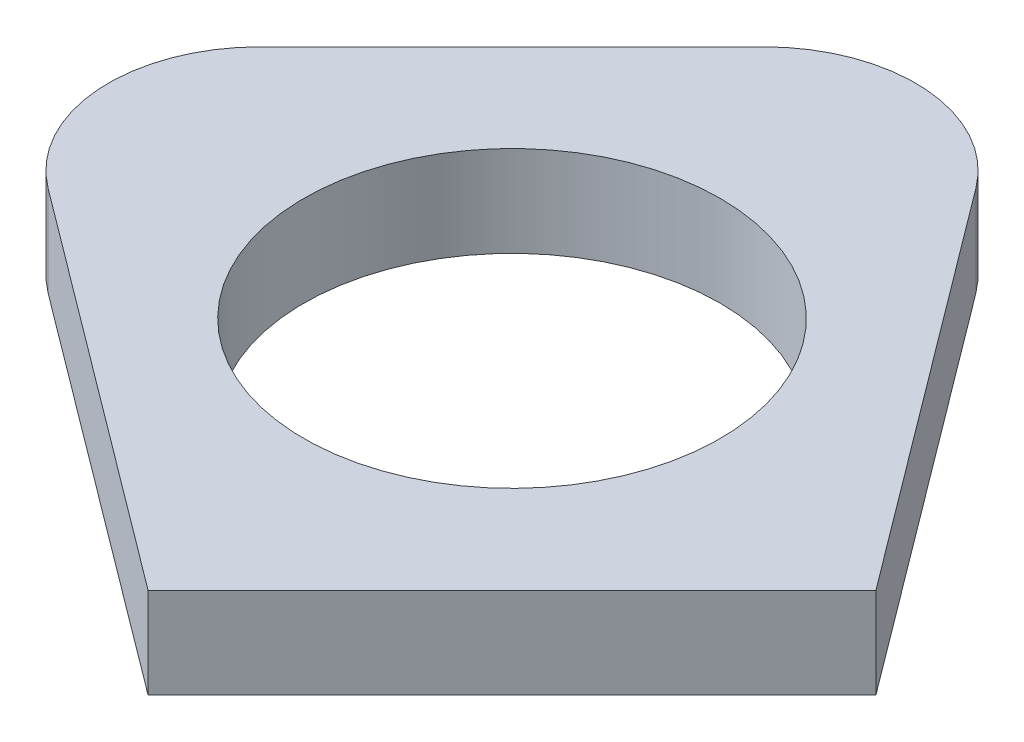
ISO-10303-21;
HEADER;
FILE_DESCRIPTION(('STEP AP214'),'2;1');
FILE_NAME('part.step','',(''),(''),'','','');
FILE_SCHEMA(('AUTOMOTIVE_DESIGN { 1 0 10303 214 1 1 1 1 }'));
ENDSEC;
DATA;
#1=APPLICATION_CONTEXT('core data for automotive mechanical design processes');
#2=APPLICATION_PROTOCOL_DEFINITION('international standard','automotive_design',2000,#1);
#3=PRODUCT_CONTEXT('',#1,'mechanical');
#4=PRODUCT('Part','Part','',(#3));
#5=PRODUCT_RELATED_PRODUCT_CATEGORY('part','',(#4));
#6=PRODUCT_DEFINITION_FORMATION('','',#4);
#7=PRODUCT_DEFINITION_CONTEXT('part definition',#1,'design');
#8=PRODUCT_DEFINITION('design','',#6,#7);
#9=PRODUCT_DEFINITION_SHAPE('','',#8);
#10=(LENGTH_UNIT() NAMED_UNIT(*) SI_UNIT(.MILLI.,.METRE.));
#11=(NAMED_UNIT(*) PLANE_ANGLE_UNIT() SI_UNIT($,.RADIAN.));
#12=(NAMED_UNIT(*) SI_UNIT($,.STERADIAN.) SOLID_ANGLE_UNIT());
#13=UNCERTAINTY_MEASURE_WITH_UNIT(LENGTH_MEASURE(1.E-05),#10,'distance_accuracy_value','');
#14=(GEOMETRIC_REPRESENTATION_CONTEXT(3) GLOBAL_UNCERTAINTY_ASSIGNED_CONTEXT((#13)) GLOBAL_UNIT_ASSIGNED_CONTEXT((#10,
#11,#12)) REPRESENTATION_CONTEXT('',''));
#15=CARTESIAN_POINT('',(0.,0.,0.));
#16=DIRECTION('',(0.,0.,1.));
#17=DIRECTION('',(1.,0.,0.));
#18=AXIS2_PLACEMENT_3D('',#15,#16,#17);
#19=CARTESIAN_POINT('',(5.18777943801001,-6.,5.18777943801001));
#20=DIRECTION('',(-0.707106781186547,0.,-0.707106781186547));
#21=DIRECTION('',(-0.707106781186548,0.,0.707106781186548));
#22=AXIS2_PLACEMENT_3D('',#19,#20,#21);
#23=PLANE('',#22);
#24=DIRECTION('',(-0.707106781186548,0.,0.707106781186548));
#25=VECTOR('',#24,1.);
#26=CARTESIAN_POINT('',(5.18777943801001,0.,5.18777943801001));
#27=LINE('',#26,#25);
#28=CARTESIAN_POINT('',(40.5146368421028,0.,-30.1390779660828));
#29=VERTEX_POINT('',#28);
#30=CARTESIAN_POINT('',(23.8609220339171,0.,-13.4853631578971));
#31=VERTEX_POINT('',#30);
#32=EDGE_CURVE('E120',#29,#31,#27,.T.);
#33=ORIENTED_EDGE('',*,*,#32,.F.);
#34=DIRECTION('',(0.,1.,0.));
#35=VECTOR('',#34,1.);
#36=CARTESIAN_POINT('',(40.5146368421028,-6.,-30.1390779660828));
#37=LINE('',#36,#35);
#38=CARTESIAN_POINT('',(40.5146368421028,-6.,-30.1390779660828));
#39=VERTEX_POINT('',#38);
#40=EDGE_CURVE('E11',#39,#29,#37,.T.);
#41=ORIENTED_EDGE('',*,*,#40,.F.);
#42=DIRECTION('',(-0.707106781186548,0.,0.707106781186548));
#43=VECTOR('',#42,1.);
#44=CARTESIAN_POINT('',(5.18777943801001,-6.,5.18777943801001));
#45=LINE('',#44,#43);
#46=CARTESIAN_POINT('',(23.8609220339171,-6.,-13.4853631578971));
#47=VERTEX_POINT('',#46);
#48=EDGE_CURVE('E136',#39,#47,#45,.T.);
#49=ORIENTED_EDGE('',*,*,#48,.T.);
#50=DIRECTION('',(0.,1.,0.));
#51=VECTOR('',#50,1.);
#52=CARTESIAN_POINT('',(23.8609220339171,-6.,-13.4853631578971));
#53=LINE('',#52,#51);
#54=EDGE_CURVE('E78',#47,#31,#53,.T.);
#55=ORIENTED_EDGE('',*,*,#54,.T.);
#56=EDGE_LOOP('',(#33,#41,#49,#55));
#57=FACE_BOUND('',#56,.T.);
#58=ADVANCED_FACE('F34',(#57),#23,.T.);
#59=CARTESIAN_POINT('',(47.5857046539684,-6.,-23.0680101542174));
#60=DIRECTION('',(0.,1.,0.));
#61=DIRECTION('',(0.,0.,1.));
#62=AXIS2_PLACEMENT_3D('',#59,#60,#61);
#63=CYLINDRICAL_SURFACE('',#62,10.);
#64=CARTESIAN_POINT('',(47.5857046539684,0.,-23.0680101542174));
#65=DIRECTION('',(0.,-1.,0.));
#66=DIRECTION('',(0.,0.,-1.));
#67=AXIS2_PLACEMENT_3D('',#64,#65,#66);
#68=CIRCLE('',#67,10.);
#69=CARTESIAN_POINT('',(55.5899662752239,0.,-29.0623237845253));
#70=VERTEX_POINT('',#69);
#71=EDGE_CURVE('E123',#70,#29,#68,.F.);
#72=ORIENTED_EDGE('',*,*,#71,.F.);
#73=DIRECTION('',(0.,1.,0.));
#74=VECTOR('',#73,1.);
#75=CARTESIAN_POINT('',(55.5899662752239,-6.,-29.0623237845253));
#76=LINE('',#75,#74);
#77=CARTESIAN_POINT('',(55.5899662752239,-6.,-29.0623237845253));
#78=VERTEX_POINT('',#77);
#79=EDGE_CURVE('E42',#78,#70,#76,.T.);
#80=ORIENTED_EDGE('',*,*,#79,.F.);
#81=CARTESIAN_POINT('',(47.5857046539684,-6.,-23.0680101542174));
#82=DIRECTION('',(0.,-1.,0.));
#83=DIRECTION('',(0.,0.,-1.));
#84=AXIS2_PLACEMENT_3D('',#81,#82,#83);
#85=CIRCLE('',#84,10.);
#86=EDGE_CURVE('E112',#78,#39,#85,.F.);
#87=ORIENTED_EDGE('',*,*,#86,.T.);
#88=ORIENTED_EDGE('',*,*,#40,.T.);
#89=EDGE_LOOP('',(#72,#80,#87,#88));
#90=FACE_BOUND('',#89,.T.);
#91=ADVANCED_FACE('F145',(#90),#63,.T.);
#92=CARTESIAN_POINT('',(49.5596118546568,-6.,-37.1147110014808));
#93=DIRECTION('',(0.800426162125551,0.,-0.599431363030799));
#94=DIRECTION('',(-0.599431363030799,0.,-0.800426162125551));
#95=AXIS2_PLACEMENT_3D('',#92,#93,#94);
#96=PLANE('',#95);
#97=DIRECTION('',(-0.599431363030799,0.,-0.800426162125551));
#98=VECTOR('',#97,1.);
#99=CARTESIAN_POINT('',(49.5596118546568,0.,-37.1147110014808));
#100=LINE('',#99,#98);
#101=CARTESIAN_POINT('',(75.3050865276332,0.,-2.73654403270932));
#102=VERTEX_POINT('',#101);
#103=EDGE_CURVE('E126',#102,#70,#100,.T.);
#104=ORIENTED_EDGE('',*,*,#103,.F.);
#105=DIRECTION('',(0.,1.,0.));
#106=VECTOR('',#105,1.);
#107=CARTESIAN_POINT('',(75.3050865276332,-6.,-2.73654403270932));
#108=LINE('',#107,#106);
#109=CARTESIAN_POINT('',(75.3050865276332,-6.,-2.73654403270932));
#110=VERTEX_POINT('',#109);
#111=EDGE_CURVE('E99',#110,#102,#108,.T.);
#112=ORIENTED_EDGE('',*,*,#111,.F.);
#113=DIRECTION('',(-0.599431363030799,0.,-0.800426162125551));
#114=VECTOR('',#113,1.);
#115=CARTESIAN_POINT('',(49.5596118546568,-6.,-37.1147110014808));
#116=LINE('',#115,#114);
#117=EDGE_CURVE('E110',#110,#78,#116,.T.);
#118=ORIENTED_EDGE('',*,*,#117,.T.);
#119=ORIENTED_EDGE('',*,*,#79,.T.);
#120=EDGE_LOOP('',(#104,#112,#118,#119));
#121=FACE_BOUND('',#120,.T.);
#122=ADVANCED_FACE('F142',(#121),#96,.T.);
#123=CARTESIAN_POINT('',(36.2842712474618,-6.,36.2842712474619));
#124=DIRECTION('',(0.707106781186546,0.,0.707106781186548));
#125=DIRECTION('',(0.707106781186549,0.,-0.707106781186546));
#126=AXIS2_PLACEMENT_3D('',#123,#124,#125);
#127=PLANE('',#126);
#128=DIRECTION('',(0.707106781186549,0.,-0.707106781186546));
#129=VECTOR('',#128,1.);
#130=CARTESIAN_POINT('',(36.2842712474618,0.,36.2842712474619));
#131=LINE('',#130,#129);
#132=CARTESIAN_POINT('',(51.2634559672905,0.,21.3050865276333));
#133=VERTEX_POINT('',#132);
#134=EDGE_CURVE('E98',#133,#102,#131,.T.);
#135=ORIENTED_EDGE('',*,*,#134,.F.);
#136=DIRECTION('',(0.,1.,0.));
#137=VECTOR('',#136,1.);
#138=CARTESIAN_POINT('',(51.2634559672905,-6.,21.3050865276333));
#139=LINE('',#138,#137);
#140=CARTESIAN_POINT('',(51.2634559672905,-6.,21.3050865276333));
#141=VERTEX_POINT('',#140);
#142=EDGE_CURVE('E92',#141,#133,#139,.T.);
#143=ORIENTED_EDGE('',*,*,#142,.F.);
#144=DIRECTION('',(0.707106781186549,0.,-0.707106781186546));
#145=VECTOR('',#144,1.);
#146=CARTESIAN_POINT('',(36.2842712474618,-6.,36.2842712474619));
#147=LINE('',#146,#145);
#148=EDGE_CURVE('E96',#141,#110,#147,.T.);
#149=ORIENTED_EDGE('',*,*,#148,.T.);
#150=ORIENTED_EDGE('',*,*,#111,.T.);
#151=EDGE_LOOP('',(#135,#143,#149,#150));
#152=FACE_BOUND('',#151,.T.);
#153=ADVANCED_FACE('F94',(#152),#127,.T.);
#154=CARTESIAN_POINT('',(8.19768823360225,-6.,-10.9464478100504));
#155=DIRECTION('',(0.599431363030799,0.,-0.800426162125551));
#156=DIRECTION('',(-0.800426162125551,0.,-0.599431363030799));
#157=AXIS2_PLACEMENT_3D('',#154,#155,#156);
#158=PLANE('',#157);
#159=DIRECTION('',(-0.800426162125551,0.,-0.599431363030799));
#160=VECTOR('',#159,1.);
#161=CARTESIAN_POINT('',(8.19768823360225,0.,-10.9464478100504));
#162=LINE('',#161,#160);
#163=CARTESIAN_POINT('',(24.9376762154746,0.,1.58996627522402));
#164=VERTEX_POINT('',#163);
#165=EDGE_CURVE('E71',#133,#164,#162,.T.);
#166=ORIENTED_EDGE('',*,*,#165,.T.);
#167=DIRECTION('',(0.,1.,0.));
#168=VECTOR('',#167,1.);
#169=CARTESIAN_POINT('',(24.9376762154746,-6.,1.58996627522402));
#170=LINE('',#169,#168);
#171=CARTESIAN_POINT('',(24.9376762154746,-6.,1.58996627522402));
#172=VERTEX_POINT('',#171);
#173=EDGE_CURVE('E100',#172,#164,#170,.T.);
#174=ORIENTED_EDGE('',*,*,#173,.F.);
#175=DIRECTION('',(-0.800426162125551,0.,-0.599431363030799));
#176=VECTOR('',#175,1.);
#177=CARTESIAN_POINT('',(8.19768823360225,-6.,-10.9464478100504));
#178=LINE('',#177,#176);
#179=EDGE_CURVE('E102',#141,#172,#178,.T.);
#180=ORIENTED_EDGE('',*,*,#179,.F.);
#181=ORIENTED_EDGE('',*,*,#142,.T.);
#182=EDGE_LOOP('',(#166,#174,#180,#181));
#183=FACE_BOUND('',#182,.T.);
#184=ADVANCED_FACE('F103',(#183),#158,.F.);
#185=CARTESIAN_POINT('',(30.9319898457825,-6.,-6.41429534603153));
#186=DIRECTION('',(0.,1.,0.));
#187=DIRECTION('',(0.,0.,1.));
#188=AXIS2_PLACEMENT_3D('',#185,#186,#187);
#189=CYLINDRICAL_SURFACE('',#188,9.99999999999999);
#190=CARTESIAN_POINT('',(30.9319898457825,0.,-6.41429534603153));
#191=DIRECTION('',(0.,-1.,0.));
#192=DIRECTION('',(0.,0.,-1.));
#193=AXIS2_PLACEMENT_3D('',#190,#191,#192);
#194=CIRCLE('',#193,9.99999999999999);
#195=EDGE_CURVE('E131',#164,#31,#194,.T.);
#196=ORIENTED_EDGE('',*,*,#195,.T.);
#197=ORIENTED_EDGE('',*,*,#54,.F.);
#198=CARTESIAN_POINT('',(30.9319898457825,-6.,-6.41429534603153));
#199=DIRECTION('',(0.,-1.,0.));
#200=DIRECTION('',(0.,0.,-1.));
#201=AXIS2_PLACEMENT_3D('',#198,#199,#200);
#202=CIRCLE('',#201,9.99999999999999);
#203=EDGE_CURVE('E50',#172,#47,#202,.T.);
#204=ORIENTED_EDGE('',*,*,#203,.F.);
#205=ORIENTED_EDGE('',*,*,#173,.T.);
#206=EDGE_LOOP('',(#196,#197,#204,#205));
#207=FACE_BOUND('',#206,.T.);
#208=ADVANCED_FACE('F151',(#207),#189,.T.);
#209=CARTESIAN_POINT('',(47.7279220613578,-6.,-6.27207793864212));
#210=DIRECTION('',(0.,1.,0.));
#211=DIRECTION('',(0.,0.,1.));
#212=AXIS2_PLACEMENT_3D('',#209,#210,#211);
#213=CYLINDRICAL_SURFACE('',#212,13.75);
#214=CARTESIAN_POINT('',(47.7279220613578,-6.,-6.27207793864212));
#215=DIRECTION('',(0.,-1.,0.));
#216=DIRECTION('',(0.,0.,-1.));
#217=AXIS2_PLACEMENT_3D('',#214,#215,#216);
#218=CIRCLE('',#217,13.75);
#219=CARTESIAN_POINT('',(47.7279220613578,-6.,-20.0220779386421));
#220=VERTEX_POINT('',#219);
#221=EDGE_CURVE('E117',#220,#220,#218,.T.);
#222=ORIENTED_EDGE('',*,*,#221,.T.);
#223=EDGE_LOOP('',(#222));
#224=FACE_BOUND('',#223,.T.);
#225=CARTESIAN_POINT('',(47.7279220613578,0.,-6.27207793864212));
#226=DIRECTION('',(0.,-1.,0.));
#227=DIRECTION('',(0.,0.,-1.));
#228=AXIS2_PLACEMENT_3D('',#225,#226,#227);
#229=CIRCLE('',#228,13.75);
#230=CARTESIAN_POINT('',(47.7279220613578,0.,-20.0220779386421));
#231=VERTEX_POINT('',#230);
#232=EDGE_CURVE('E133',#231,#231,#229,.T.);
#233=ORIENTED_EDGE('',*,*,#232,.F.);
#234=EDGE_LOOP('',(#233));
#235=FACE_BOUND('',#234,.T.);
#236=ADVANCED_FACE('F168',(#224,#235),#213,.F.);
#237=CARTESIAN_POINT('',(0.,-6.,0.));
#238=DIRECTION('',(0.,-1.,0.));
#239=DIRECTION('',(0.,0.,-1.));
#240=AXIS2_PLACEMENT_3D('',#237,#238,#239);
#241=PLANE('',#240);
#242=ORIENTED_EDGE('',*,*,#48,.F.);
#243=ORIENTED_EDGE('',*,*,#86,.F.);
#244=ORIENTED_EDGE('',*,*,#117,.F.);
#245=ORIENTED_EDGE('',*,*,#148,.F.);
#246=ORIENTED_EDGE('',*,*,#179,.T.);
#247=ORIENTED_EDGE('',*,*,#203,.T.);
#248=EDGE_LOOP('',(#242,#243,#244,#245,#246,#247));
#249=FACE_BOUND('',#248,.T.);
#250=ORIENTED_EDGE('',*,*,#221,.F.);
#251=EDGE_LOOP('',(#250));
#252=FACE_BOUND('',#251,.T.);
#253=ADVANCED_FACE('F106',(#249,#252),#241,.T.);
#254=CARTESIAN_POINT('',(0.,0.,0.));
#255=DIRECTION('',(0.,-1.,0.));
#256=DIRECTION('',(0.,0.,-1.));
#257=AXIS2_PLACEMENT_3D('',#254,#255,#256);
#258=PLANE('',#257);
#259=ORIENTED_EDGE('',*,*,#32,.T.);
#260=ORIENTED_EDGE('',*,*,#195,.F.);
#261=ORIENTED_EDGE('',*,*,#165,.F.);
#262=ORIENTED_EDGE('',*,*,#134,.T.);
#263=ORIENTED_EDGE('',*,*,#103,.T.);
#264=ORIENTED_EDGE('',*,*,#71,.T.);
#265=EDGE_LOOP('',(#259,#260,#261,#262,#263,#264));
#266=FACE_BOUND('',#265,.T.);
#267=ORIENTED_EDGE('',*,*,#232,.T.);
#268=EDGE_LOOP('',(#267));
#269=FACE_BOUND('',#268,.T.);
#270=ADVANCED_FACE('F147',(#266,#269),#258,.F.);
#271=CLOSED_SHELL('',(#58,#91,#122,#153,#184,#208,#236,#253,#270));
#272=MANIFOLD_SOLID_BREP('B2',#271);
#273=ADVANCED_BREP_SHAPE_REPRESENTATION('',(#18,#272),#14);
#274=SHAPE_DEFINITION_REPRESENTATION(#9,#273);
ENDSEC;
END-ISO-10303-21;
